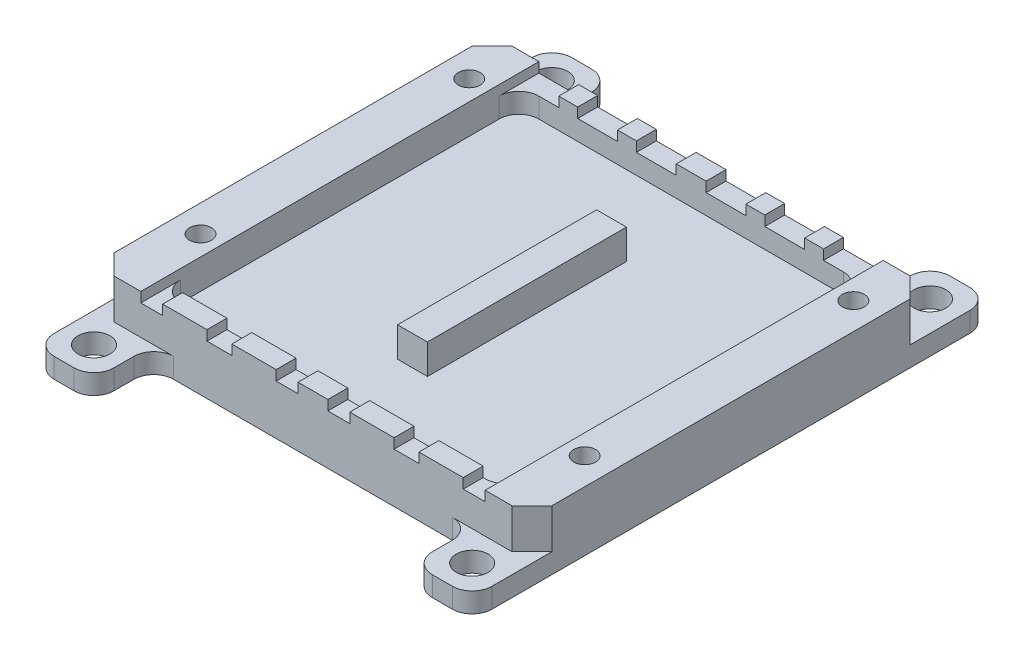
from build123d import *

# Parameters (mm, degrees)
SKETCH_1_R          = 1.6
EXTRUDE_1_DEPTH     = 2
FILLET_1_R          = 2
SKETCH_2_W          = 44
SKETCH_2_H          = 40
EXTRUDE_2_DEPTH     = 4
CHAMFER_1_SIZE      = 2
SKETCH_3_W          = 34.6
SKETCH_3_H          = 36
SKETCH_3_W_2        = 3
SKETCH_3_H_2        = 20
CUT_EXTRUDE_1_DEPTH = 3
SKETCH_4_W          = 2.2
SKETCH_4_H          = 2
SKETCH_4_W_2        = 4
SKETCH_4_W_3        = 2.5
CUT_EXTRUDE_2_DEPTH = 1
FILLET_2_R          = 2
SKETCH_5_R          = 1.1
CUT_EXTRUDE_3_DEPTH = 35.583232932
SKETCH_6_R          = 2
CUT_EXTRUDE_4_DEPTH = 2.5


with BuildPart() as part:
    # Sketch 1 → Extrude 1 (new body)
    with BuildSketch(Plane(origin=(0, 0, 0), x_dir=(1, 0, 0), z_dir=(0, 1, 0))):
        Polygon((22, 20), (22, 26), (16, 26), (16, 20), (-16, 20), (-16, 26), (-22, 26), (-22, 20), (-22, -20), (-22, -26), (-16, -26), (-16, -20), (16, -20), (16, -26), (22, -26), (22, -20), align=None)
        with Locations(Location((19, 23, 0), (0, 0, 270))):
            Circle(SKETCH_1_R, mode=Mode.SUBTRACT)
        with Locations(Location((-19, 23, 0), (0, 0, 270))):
            Circle(SKETCH_1_R, mode=Mode.SUBTRACT)
        with Locations(Location((-19, -23, 0), (0, 0, 270))):
            Circle(SKETCH_1_R, mode=Mode.SUBTRACT)
        with Locations(Location((19, -23, 0), (0, 0, 270))):
            Circle(SKETCH_1_R, mode=Mode.SUBTRACT)
    extrude(amount=EXTRUDE_1_DEPTH)

    # Fillet 1
    fillet_1_edges = [part.edges().sort_by_distance(p)[0] for p in [
        (22, 1, 26),
        (16, 1, 26),
        (16, 1, 20),
        (-16, 1, 20),
        (-16, 1, 26),
        (-22, 1, 26),
        (-22, 1, -26),
        (-16, 1, -26),
        (-16, 1, -20),
        (16, 1, -20),
        (16, 1, -26),
        (22, 1, -26),
    ]]
    fillet(fillet_1_edges, radius=FILLET_1_R)

    # Sketch 2 → Extrude 2 (add)
    with BuildSketch(Plane(origin=(0, 2, 0), x_dir=(1, 0, 0), z_dir=(0, 1, 0))):
        Rectangle(SKETCH_2_W, SKETCH_2_H)
    extrude(amount=EXTRUDE_2_DEPTH)

    # Chamfer 1
    chamfer_1_edges = [part.edges().sort_by_distance(p)[0] for p in [
        (22, 4, -20),
        (-22, 4, -20),
        (-22, 4, 20),
        (22, 4, 20),
    ]]
    chamfer(chamfer_1_edges, length=CHAMFER_1_SIZE)

    # Sketch 3 → Cut-Extrude 1 (cut)
    with BuildSketch(Plane(origin=(0, 6, 0), x_dir=(1, 0, 0), z_dir=(0, 1, 0))):
        Rectangle(SKETCH_3_W, SKETCH_3_H)
        Rectangle(SKETCH_3_W_2, SKETCH_3_H_2, mode=Mode.SUBTRACT)
    extrude(amount=-CUT_EXTRUDE_1_DEPTH, mode=Mode.SUBTRACT)

    # Sketch 4 → Cut-Extrude 2 (cut)
    with BuildSketch(Plane(origin=(0, 6, 0), x_dir=(1, 0, 0), z_dir=(0, 1, 0))):
        with Locations((16.2, -19)):
            Rectangle(SKETCH_4_W, SKETCH_4_H)
        with Locations((-15.3, 19)):
            Rectangle(SKETCH_4_W_2, SKETCH_4_H)
        with Locations((15.3, 19)):
            Rectangle(SKETCH_4_W_2, SKETCH_4_H)
        with Locations((-16.2, -19)):
            Rectangle(SKETCH_4_W, SKETCH_4_H)
        with Locations((-3.5, 19)):
            Rectangle(SKETCH_4_W_2, SKETCH_4_H)
        with Locations((3.5, 19)):
            Rectangle(SKETCH_4_W_2, SKETCH_4_H)
        with Locations((2.6, -19)):
            Rectangle(SKETCH_4_W, SKETCH_4_H)
        with Locations((9.4, 19)):
            Rectangle(SKETCH_4_W_2, SKETCH_4_H)
        with Locations((-9.4, 19)):
            Rectangle(SKETCH_4_W_2, SKETCH_4_H)
        with Locations((-2.6, -19)):
            Rectangle(SKETCH_4_W, SKETCH_4_H)
        with Locations((-9.4, -19)):
            Rectangle(SKETCH_4_W_3, SKETCH_4_H)
        with Locations((9.4, -19)):
            Rectangle(SKETCH_4_W_3, SKETCH_4_H)
    extrude(amount=-CUT_EXTRUDE_2_DEPTH, mode=Mode.SUBTRACT)

    # Fillet 2
    fillet_2_edges = [part.edges().sort_by_distance(p)[0] for p in [
        (-17.3, 4, -18),
        (17.3, 4, -18),
        (17.3, 4, 18),
        (-17.3, 4, 18),
    ]]
    fillet(fillet_2_edges, radius=FILLET_2_R)

    # Sketch 5 → Cut-Extrude 3 (cut, through all)
    with BuildSketch(Plane(origin=(0, 6, 0), x_dir=(1, 0, 0), z_dir=(0, 1, 0))):
        with Locations(Location((19.3, 15, 0), (0, 0, 270))):
            Circle(SKETCH_5_R)
        with Locations(Location((19.3, -12, 0), (0, 0, 270))):
            Circle(SKETCH_5_R)
        with Locations(Location((-19.3, -12, 0), (0, 0, 270))):
            Circle(SKETCH_5_R)
        with Locations(Location((-19.3, 15, 0), (0, 0, 270))):
            Circle(SKETCH_5_R)
    extrude(amount=-CUT_EXTRUDE_3_DEPTH, mode=Mode.SUBTRACT)

    # Sketch 6 → Cut-Extrude 4 (cut)
    with BuildSketch(Plane.XZ):
        with Locations(Location((19.3, 12, 0), (0, 0, 270))):
            Circle(SKETCH_6_R)
        with Locations(Location((-19.3, 12, 0), (0, 0, 270))):
            Circle(SKETCH_6_R)
        with Locations(Location((-19.3, -15, 0), (0, 0, 270))):
            Circle(SKETCH_6_R)
        with Locations(Location((19.3, -15, 0), (0, 0, 270))):
            Circle(SKETCH_6_R)
    extrude(amount=-CUT_EXTRUDE_4_DEPTH, mode=Mode.SUBTRACT)


solid = part.part
